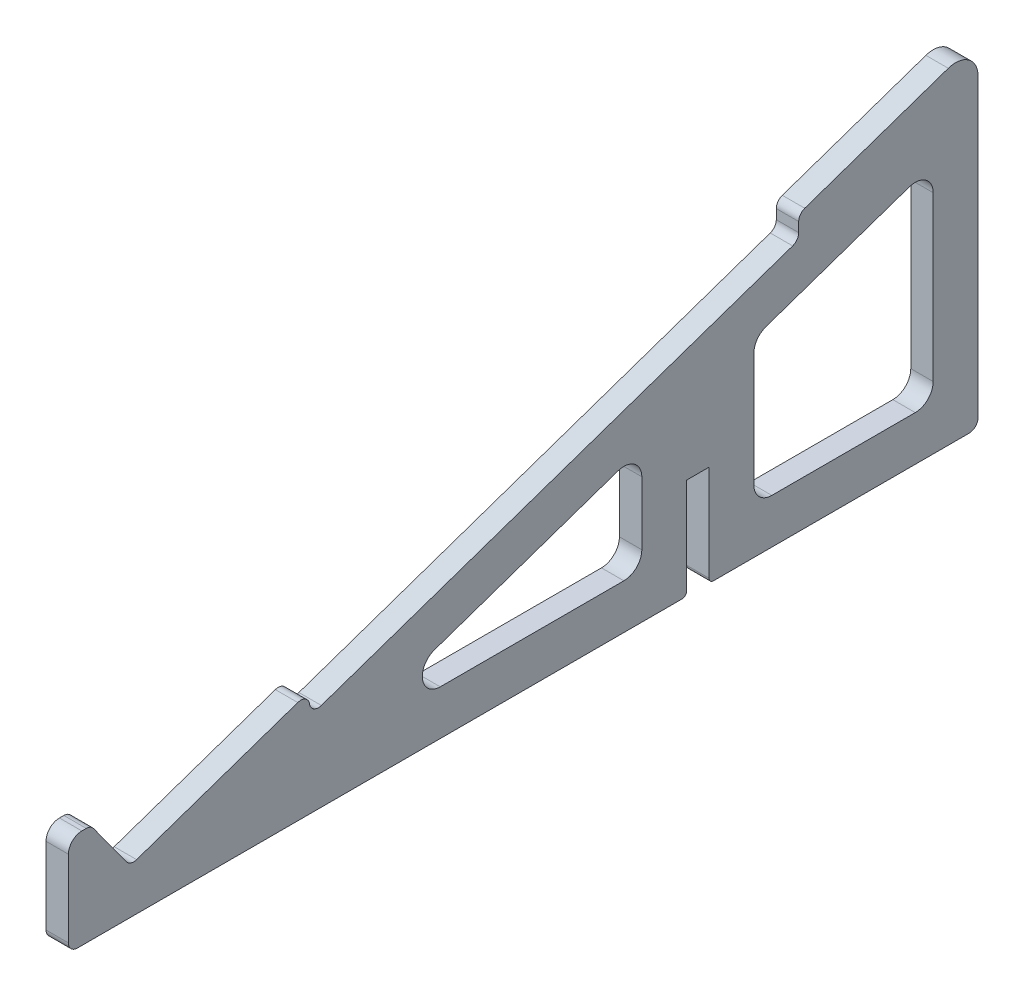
ISO-10303-21;
HEADER;
FILE_DESCRIPTION(('STEP AP214'),'2;1');
FILE_NAME('part.step','',(''),(''),'','','');
FILE_SCHEMA(('AUTOMOTIVE_DESIGN { 1 0 10303 214 1 1 1 1 }'));
ENDSEC;
DATA;
#1=APPLICATION_CONTEXT('core data for automotive mechanical design processes');
#2=APPLICATION_PROTOCOL_DEFINITION('international standard','automotive_design',2000,#1);
#3=PRODUCT_CONTEXT('',#1,'mechanical');
#4=PRODUCT('Part','Part','',(#3));
#5=PRODUCT_RELATED_PRODUCT_CATEGORY('part','',(#4));
#6=PRODUCT_DEFINITION_FORMATION('','',#4);
#7=PRODUCT_DEFINITION_CONTEXT('part definition',#1,'design');
#8=PRODUCT_DEFINITION('design','',#6,#7);
#9=PRODUCT_DEFINITION_SHAPE('','',#8);
#10=(LENGTH_UNIT() NAMED_UNIT(*) SI_UNIT(.MILLI.,.METRE.));
#11=(NAMED_UNIT(*) PLANE_ANGLE_UNIT() SI_UNIT($,.RADIAN.));
#12=(NAMED_UNIT(*) SI_UNIT($,.STERADIAN.) SOLID_ANGLE_UNIT());
#13=UNCERTAINTY_MEASURE_WITH_UNIT(LENGTH_MEASURE(1.E-05),#10,'distance_accuracy_value','');
#14=(GEOMETRIC_REPRESENTATION_CONTEXT(3) GLOBAL_UNCERTAINTY_ASSIGNED_CONTEXT((#13)) GLOBAL_UNIT_ASSIGNED_CONTEXT((#10,
#11,#12)) REPRESENTATION_CONTEXT('',''));
#15=CARTESIAN_POINT('',(0.,0.,0.));
#16=DIRECTION('',(0.,0.,1.));
#17=DIRECTION('',(1.,0.,0.));
#18=AXIS2_PLACEMENT_3D('',#15,#16,#17);
#19=CARTESIAN_POINT('',(6.35,0.,128.854513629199));
#20=DIRECTION('',(0.,1.,0.));
#21=DIRECTION('',(0.,0.,1.));
#22=AXIS2_PLACEMENT_3D('',#19,#20,#21);
#23=PLANE('',#22);
#24=DIRECTION('',(0.,0.,-1.));
#25=VECTOR('',#24,1.);
#26=CARTESIAN_POINT('',(0.,0.,128.854513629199));
#27=LINE('',#26,#25);
#28=CARTESIAN_POINT('',(0.,0.,126.314513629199));
#29=VERTEX_POINT('',#28);
#30=CARTESIAN_POINT('',(0.,0.,-45.0345136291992));
#31=VERTEX_POINT('',#30);
#32=EDGE_CURVE('E347',#29,#31,#27,.T.);
#33=ORIENTED_EDGE('',*,*,#32,.T.);
#34=DIRECTION('',(1.,0.,0.));
#35=VECTOR('',#34,1.);
#36=CARTESIAN_POINT('',(6.35,0.,-45.0345136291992));
#37=LINE('',#36,#35);
#38=CARTESIAN_POINT('',(6.35,0.,-45.0345136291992));
#39=VERTEX_POINT('',#38);
#40=EDGE_CURVE('E41',#31,#39,#37,.T.);
#41=ORIENTED_EDGE('',*,*,#40,.T.);
#42=DIRECTION('',(0.,0.,-1.));
#43=VECTOR('',#42,1.);
#44=CARTESIAN_POINT('',(6.35,0.,128.854513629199));
#45=LINE('',#44,#43);
#46=CARTESIAN_POINT('',(6.35,0.,126.314513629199));
#47=VERTEX_POINT('',#46);
#48=EDGE_CURVE('E329',#47,#39,#45,.T.);
#49=ORIENTED_EDGE('',*,*,#48,.F.);
#50=DIRECTION('',(-1.,0.,0.));
#51=VECTOR('',#50,1.);
#52=CARTESIAN_POINT('',(6.35,0.,126.314513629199));
#53=LINE('',#52,#51);
#54=EDGE_CURVE('E389',#47,#29,#53,.T.);
#55=ORIENTED_EDGE('',*,*,#54,.T.);
#56=EDGE_LOOP('',(#33,#41,#49,#55));
#57=FACE_BOUND('',#56,.T.);
#58=ADVANCED_FACE('F33',(#57),#23,.F.);
#59=CARTESIAN_POINT('',(6.35,95.3943112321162,-128.854513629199));
#60=DIRECTION('',(0.,-0.945518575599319,-0.32556815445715));
#61=DIRECTION('',(0.,0.32556815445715,-0.945518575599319));
#62=AXIS2_PLACEMENT_3D('',#59,#60,#61);
#63=PLANE('',#62);
#64=DIRECTION('',(0.,-0.32556815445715,0.945518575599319));
#65=VECTOR('',#64,1.);
#66=CARTESIAN_POINT('',(6.35,95.3943112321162,-128.854513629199));
#67=LINE('',#66,#65);
#68=CARTESIAN_POINT('',(6.35,92.4959825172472,-120.437155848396));
#69=VERTEX_POINT('',#68);
#70=CARTESIAN_POINT('',(6.35,78.4923212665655,-79.7675705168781));
#71=VERTEX_POINT('',#70);
#72=EDGE_CURVE('E336',#69,#71,#67,.T.);
#73=ORIENTED_EDGE('',*,*,#72,.F.);
#74=DIRECTION('',(-1.,0.,0.));
#75=VECTOR('',#74,1.);
#76=CARTESIAN_POINT('',(6.35,92.4959825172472,-120.437155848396));
#77=LINE('',#76,#75);
#78=CARTESIAN_POINT('',(0.,92.4959825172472,-120.437155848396));
#79=VERTEX_POINT('',#78);
#80=EDGE_CURVE('E445',#69,#79,#77,.T.);
#81=ORIENTED_EDGE('',*,*,#80,.T.);
#82=DIRECTION('',(0.,-0.32556815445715,0.945518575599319));
#83=VECTOR('',#82,1.);
#84=CARTESIAN_POINT('',(0.,95.3943112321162,-128.854513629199));
#85=LINE('',#84,#83);
#86=CARTESIAN_POINT('',(0.,78.4923212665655,-79.7675705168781));
#87=VERTEX_POINT('',#86);
#88=EDGE_CURVE('E353',#79,#87,#85,.T.);
#89=ORIENTED_EDGE('',*,*,#88,.T.);
#90=DIRECTION('',(1.,0.,0.));
#91=VECTOR('',#90,1.);
#92=CARTESIAN_POINT('',(6.35,78.4923212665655,-79.7675705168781));
#93=LINE('',#92,#91);
#94=EDGE_CURVE('E344',#87,#71,#93,.T.);
#95=ORIENTED_EDGE('',*,*,#94,.T.);
#96=EDGE_LOOP('',(#73,#81,#89,#95));
#97=FACE_BOUND('',#96,.T.);
#98=ADVANCED_FACE('F606',(#97),#63,.F.);
#99=CARTESIAN_POINT('',(6.35,0.,128.854513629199));
#100=DIRECTION('',(0.,0.,-1.));
#101=DIRECTION('',(0.,1.,0.));
#102=AXIS2_PLACEMENT_3D('',#99,#100,#101);
#103=PLANE('',#102);
#104=DIRECTION('',(0.,-1.,0.));
#105=VECTOR('',#104,1.);
#106=CARTESIAN_POINT('',(6.35,0.,128.854513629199));
#107=LINE('',#106,#105);
#108=CARTESIAN_POINT('',(6.35,24.3017737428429,128.854513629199));
#109=VERTEX_POINT('',#108);
#110=CARTESIAN_POINT('',(6.35,2.54,128.854513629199));
#111=VERTEX_POINT('',#110);
#112=EDGE_CURVE('E325',#109,#111,#107,.T.);
#113=ORIENTED_EDGE('',*,*,#112,.F.);
#114=DIRECTION('',(-1.,0.,0.));
#115=VECTOR('',#114,1.);
#116=CARTESIAN_POINT('',(6.35,24.3017737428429,128.854513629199));
#117=LINE('',#116,#115);
#118=CARTESIAN_POINT('',(0.,24.3017737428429,128.854513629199));
#119=VERTEX_POINT('',#118);
#120=EDGE_CURVE('E436',#109,#119,#117,.T.);
#121=ORIENTED_EDGE('',*,*,#120,.T.);
#122=DIRECTION('',(0.,-1.,0.));
#123=VECTOR('',#122,1.);
#124=CARTESIAN_POINT('',(0.,0.,128.854513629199));
#125=LINE('',#124,#123);
#126=CARTESIAN_POINT('',(0.,2.54,128.854513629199));
#127=VERTEX_POINT('',#126);
#128=EDGE_CURVE('E321',#119,#127,#125,.T.);
#129=ORIENTED_EDGE('',*,*,#128,.T.);
#130=DIRECTION('',(-1.,0.,0.));
#131=VECTOR('',#130,1.);
#132=CARTESIAN_POINT('',(6.35,2.54,128.854513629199));
#133=LINE('',#132,#131);
#134=EDGE_CURVE('E401',#127,#111,#133,.F.);
#135=ORIENTED_EDGE('',*,*,#134,.T.);
#136=EDGE_LOOP('',(#113,#121,#129,#135));
#137=FACE_BOUND('',#136,.T.);
#138=ADVANCED_FACE('F545',(#137),#103,.F.);
#139=CARTESIAN_POINT('',(6.35,0.,-53.9245136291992));
#140=VERTEX_POINT('',#139);
#141=CARTESIAN_POINT('',(6.35,0.,-126.314513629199));
#142=VERTEX_POINT('',#141);
#143=EDGE_CURVE('E327',#140,#142,#45,.T.);
#144=ORIENTED_EDGE('',*,*,#143,.F.);
#145=DIRECTION('',(1.,0.,0.));
#146=VECTOR('',#145,1.);
#147=CARTESIAN_POINT('',(6.35,0.,-53.9245136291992));
#148=LINE('',#147,#146);
#149=CARTESIAN_POINT('',(0.,0.,-53.9245136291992));
#150=VERTEX_POINT('',#149);
#151=EDGE_CURVE('E524',#140,#150,#148,.F.);
#152=ORIENTED_EDGE('',*,*,#151,.T.);
#153=CARTESIAN_POINT('',(0.,0.,-126.314513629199));
#154=VERTEX_POINT('',#153);
#155=EDGE_CURVE('E346',#150,#154,#27,.T.);
#156=ORIENTED_EDGE('',*,*,#155,.T.);
#157=DIRECTION('',(-1.,0.,0.));
#158=VECTOR('',#157,1.);
#159=CARTESIAN_POINT('',(6.35,0.,-126.314513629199));
#160=LINE('',#159,#158);
#161=EDGE_CURVE('E392',#154,#142,#160,.F.);
#162=ORIENTED_EDGE('',*,*,#161,.T.);
#163=EDGE_LOOP('',(#144,#152,#156,#162));
#164=FACE_BOUND('',#163,.T.);
#165=ADVANCED_FACE('F637',(#164),#23,.F.);
#166=CARTESIAN_POINT('',(6.35,0.,-128.854513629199));
#167=DIRECTION('',(0.,0.,1.));
#168=DIRECTION('',(1.,0.,0.));
#169=AXIS2_PLACEMENT_3D('',#166,#167,#168);
#170=PLANE('',#169);
#171=DIRECTION('',(0.,1.,0.));
#172=VECTOR('',#171,1.);
#173=CARTESIAN_POINT('',(0.,0.,-128.854513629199));
#174=LINE('',#173,#172);
#175=CARTESIAN_POINT('',(0.,2.54,-128.854513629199));
#176=VERTEX_POINT('',#175);
#177=CARTESIAN_POINT('',(0.,86.4919395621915,-128.854513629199));
#178=VERTEX_POINT('',#177);
#179=EDGE_CURVE('E349',#176,#178,#174,.T.);
#180=ORIENTED_EDGE('',*,*,#179,.T.);
#181=DIRECTION('',(-1.,0.,0.));
#182=VECTOR('',#181,1.);
#183=CARTESIAN_POINT('',(6.35,86.4919395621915,-128.854513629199));
#184=LINE('',#183,#182);
#185=CARTESIAN_POINT('',(6.35,86.4919395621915,-128.854513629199));
#186=VERTEX_POINT('',#185);
#187=EDGE_CURVE('E450',#178,#186,#184,.F.);
#188=ORIENTED_EDGE('',*,*,#187,.T.);
#189=DIRECTION('',(0.,1.,0.));
#190=VECTOR('',#189,1.);
#191=CARTESIAN_POINT('',(6.35,0.,-128.854513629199));
#192=LINE('',#191,#190);
#193=CARTESIAN_POINT('',(6.35,2.54,-128.854513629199));
#194=VERTEX_POINT('',#193);
#195=EDGE_CURVE('E332',#194,#186,#192,.T.);
#196=ORIENTED_EDGE('',*,*,#195,.F.);
#197=DIRECTION('',(-1.,0.,0.));
#198=VECTOR('',#197,1.);
#199=CARTESIAN_POINT('',(6.35,2.54,-128.854513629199));
#200=LINE('',#199,#198);
#201=EDGE_CURVE('E378',#194,#176,#200,.T.);
#202=ORIENTED_EDGE('',*,*,#201,.T.);
#203=EDGE_LOOP('',(#180,#188,#196,#202));
#204=FACE_BOUND('',#203,.T.);
#205=ADVANCED_FACE('F614',(#204),#170,.F.);
#206=CARTESIAN_POINT('',(0.,29.032511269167,63.874147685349));
#207=VERTEX_POINT('',#206);
#208=CARTESIAN_POINT('',(0.,13.3119057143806,109.530101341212));
#209=VERTEX_POINT('',#208);
#210=EDGE_CURVE('E352',#207,#209,#85,.T.);
#211=ORIENTED_EDGE('',*,*,#210,.T.);
#212=DIRECTION('',(-1.,0.,0.));
#213=VECTOR('',#212,1.);
#214=CARTESIAN_POINT('',(6.35,13.3119057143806,109.530101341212));
#215=LINE('',#214,#213);
#216=CARTESIAN_POINT('',(6.35,13.3119057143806,109.530101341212));
#217=VERTEX_POINT('',#216);
#218=EDGE_CURVE('E412',#209,#217,#215,.F.);
#219=ORIENTED_EDGE('',*,*,#218,.T.);
#220=CARTESIAN_POINT('',(6.35,29.032511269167,63.874147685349));
#221=VERTEX_POINT('',#220);
#222=EDGE_CURVE('E335',#221,#217,#67,.T.);
#223=ORIENTED_EDGE('',*,*,#222,.F.);
#224=DIRECTION('',(1.,0.,0.));
#225=VECTOR('',#224,1.);
#226=CARTESIAN_POINT('',(6.35,29.032511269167,63.874147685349));
#227=LINE('',#226,#225);
#228=EDGE_CURVE('E376',#221,#207,#227,.F.);
#229=ORIENTED_EDGE('',*,*,#228,.T.);
#230=EDGE_LOOP('',(#211,#219,#223,#229));
#231=FACE_BOUND('',#230,.T.);
#232=ADVANCED_FACE('F572',(#231),#63,.F.);
#233=CARTESIAN_POINT('',(6.35,12.7,111.307204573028));
#234=DIRECTION('',(0.,-0.587785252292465,0.809016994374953));
#235=DIRECTION('',(0.,-0.809016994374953,-0.587785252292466));
#236=AXIS2_PLACEMENT_3D('',#233,#234,#235);
#237=PLANE('',#236);
#238=DIRECTION('',(0.,0.809016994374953,0.587785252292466));
#239=VECTOR('',#238,1.);
#240=CARTESIAN_POINT('',(0.,12.7,111.307204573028));
#241=LINE('',#240,#239);
#242=CARTESIAN_POINT('',(0.,14.22054835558,112.411947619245));
#243=VERTEX_POINT('',#242);
#244=CARTESIAN_POINT('',(0.,27.0647482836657,121.743805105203));
#245=VERTEX_POINT('',#244);
#246=EDGE_CURVE('E355',#243,#245,#241,.T.);
#247=ORIENTED_EDGE('',*,*,#246,.T.);
#248=DIRECTION('',(-1.,0.,0.));
#249=VECTOR('',#248,1.);
#250=CARTESIAN_POINT('',(6.35,27.0647482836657,121.743805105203));
#251=LINE('',#250,#249);
#252=CARTESIAN_POINT('',(6.35,27.0647482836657,121.743805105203));
#253=VERTEX_POINT('',#252);
#254=EDGE_CURVE('E410',#245,#253,#251,.F.);
#255=ORIENTED_EDGE('',*,*,#254,.T.);
#256=DIRECTION('',(0.,0.809016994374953,0.587785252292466));
#257=VECTOR('',#256,1.);
#258=CARTESIAN_POINT('',(6.35,12.7,111.307204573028));
#259=LINE('',#258,#257);
#260=CARTESIAN_POINT('',(6.35,14.22054835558,112.411947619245));
#261=VERTEX_POINT('',#260);
#262=EDGE_CURVE('E338',#261,#253,#259,.T.);
#263=ORIENTED_EDGE('',*,*,#262,.F.);
#264=DIRECTION('',(-1.,0.,0.));
#265=VECTOR('',#264,1.);
#266=CARTESIAN_POINT('',(0.,14.22054835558,112.411947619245));
#267=LINE('',#266,#265);
#268=EDGE_CURVE('E407',#261,#243,#267,.T.);
#269=ORIENTED_EDGE('',*,*,#268,.T.);
#270=EDGE_LOOP('',(#247,#255,#263,#269));
#271=FACE_BOUND('',#270,.T.);
#272=ADVANCED_FACE('F562',(#271),#237,.F.);
#273=CARTESIAN_POINT('',(6.35,28.1117737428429,122.504513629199));
#274=DIRECTION('',(0.,-1.,0.));
#275=DIRECTION('',(0.,0.,-1.));
#276=AXIS2_PLACEMENT_3D('',#273,#274,#275);
#277=PLANE('',#276);
#278=DIRECTION('',(0.,0.,1.));
#279=VECTOR('',#278,1.);
#280=CARTESIAN_POINT('',(0.,28.1117737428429,122.504513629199));
#281=LINE('',#280,#279);
#282=CARTESIAN_POINT('',(0.,28.1117737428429,123.798708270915));
#283=VERTEX_POINT('',#282);
#284=CARTESIAN_POINT('',(0.,28.1117737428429,125.044513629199));
#285=VERTEX_POINT('',#284);
#286=EDGE_CURVE('E328',#283,#285,#281,.T.);
#287=ORIENTED_EDGE('',*,*,#286,.T.);
#288=DIRECTION('',(-1.,0.,0.));
#289=VECTOR('',#288,1.);
#290=CARTESIAN_POINT('',(6.35,28.1117737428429,125.044513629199));
#291=LINE('',#290,#289);
#292=CARTESIAN_POINT('',(6.35,28.1117737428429,125.044513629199));
#293=VERTEX_POINT('',#292);
#294=EDGE_CURVE('E441',#285,#293,#291,.F.);
#295=ORIENTED_EDGE('',*,*,#294,.T.);
#296=DIRECTION('',(0.,0.,1.));
#297=VECTOR('',#296,1.);
#298=CARTESIAN_POINT('',(6.35,28.1117737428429,122.504513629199));
#299=LINE('',#298,#297);
#300=CARTESIAN_POINT('',(6.35,28.1117737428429,123.798708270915));
#301=VERTEX_POINT('',#300);
#302=EDGE_CURVE('E341',#301,#293,#299,.T.);
#303=ORIENTED_EDGE('',*,*,#302,.F.);
#304=DIRECTION('',(-1.,0.,0.));
#305=VECTOR('',#304,1.);
#306=CARTESIAN_POINT('',(6.35,28.1117737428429,123.798708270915));
#307=LINE('',#306,#305);
#308=EDGE_CURVE('E404',#301,#283,#307,.T.);
#309=ORIENTED_EDGE('',*,*,#308,.T.);
#310=EDGE_LOOP('',(#287,#295,#303,#309));
#311=FACE_BOUND('',#310,.T.);
#312=ADVANCED_FACE('F553',(#311),#277,.F.);
#313=CARTESIAN_POINT('',(6.35,0.,0.));
#314=DIRECTION('',(1.,0.,0.));
#315=DIRECTION('',(0.,0.,-1.));
#316=AXIS2_PLACEMENT_3D('',#313,#314,#315);
#317=PLANE('',#316);
#318=DIRECTION('',(0.,0.,-1.));
#319=VECTOR('',#318,1.);
#320=CARTESIAN_POINT('',(6.35,12.7,53.8567362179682));
#321=LINE('',#320,#319);
#322=CARTESIAN_POINT('',(6.35,12.7,23.4998532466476));
#323=VERTEX_POINT('',#322);
#324=CARTESIAN_POINT('',(6.35,12.7,-28.5245136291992));
#325=VERTEX_POINT('',#324);
#326=EDGE_CURVE('E1047',#323,#325,#321,.T.);
#327=ORIENTED_EDGE('',*,*,#326,.F.);
#328=CARTESIAN_POINT('',(6.35,17.78,23.4998532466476));
#329=DIRECTION('',(1.,0.,0.));
#330=DIRECTION('',(0.,0.,-1.));
#331=AXIS2_PLACEMENT_3D('',#328,#329,#330);
#332=CIRCLE('',#331,5.08);
#333=CARTESIAN_POINT('',(6.35,22.5832343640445,25.15373947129));
#334=VERTEX_POINT('',#333);
#335=EDGE_CURVE('E501',#323,#334,#332,.F.);
#336=ORIENTED_EDGE('',*,*,#335,.T.);
#337=DIRECTION('',(0.,-0.325568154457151,0.945518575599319));
#338=VECTOR('',#337,1.);
#339=CARTESIAN_POINT('',(6.35,42.8153234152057,-33.6045136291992));
#340=LINE('',#339,#338);
#341=CARTESIAN_POINT('',(6.35,40.4966604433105,-26.8706274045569));
#342=VERTEX_POINT('',#341);
#343=EDGE_CURVE('E726',#342,#334,#340,.T.);
#344=ORIENTED_EDGE('',*,*,#343,.F.);
#345=CARTESIAN_POINT('',(6.35,35.6934260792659,-28.5245136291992));
#346=DIRECTION('',(1.,0.,0.));
#347=DIRECTION('',(0.,0.,-1.));
#348=AXIS2_PLACEMENT_3D('',#345,#346,#347);
#349=CIRCLE('',#348,5.08);
#350=CARTESIAN_POINT('',(6.35,35.6934260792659,-33.6045136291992));
#351=VERTEX_POINT('',#350);
#352=EDGE_CURVE('E509',#342,#351,#349,.F.);
#353=ORIENTED_EDGE('',*,*,#352,.T.);
#354=DIRECTION('',(0.,1.,0.));
#355=VECTOR('',#354,1.);
#356=CARTESIAN_POINT('',(6.35,12.7,-33.6045136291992));
#357=LINE('',#356,#355);
#358=CARTESIAN_POINT('',(6.35,17.78,-33.6045136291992));
#359=VERTEX_POINT('',#358);
#360=EDGE_CURVE('E1048',#359,#351,#357,.T.);
#361=ORIENTED_EDGE('',*,*,#360,.F.);
#362=CARTESIAN_POINT('',(6.35,17.78,-28.5245136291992));
#363=DIRECTION('',(1.,0.,0.));
#364=DIRECTION('',(0.,0.,-1.));
#365=AXIS2_PLACEMENT_3D('',#362,#363,#364);
#366=CIRCLE('',#365,5.08);
#367=EDGE_CURVE('E493',#359,#325,#366,.F.);
#368=ORIENTED_EDGE('',*,*,#367,.T.);
#369=EDGE_LOOP('',(#327,#336,#344,#353,#361,#368));
#370=FACE_BOUND('',#369,.T.);
#371=DIRECTION('',(0.,-1.,0.));
#372=VECTOR('',#371,1.);
#373=CARTESIAN_POINT('',(6.35,53.7477251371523,-65.3545136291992));
#374=LINE('',#373,#372);
#375=CARTESIAN_POINT('',(6.35,50.1241963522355,-65.3545136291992));
#376=VERTEX_POINT('',#375);
#377=CARTESIAN_POINT('',(6.35,17.78,-65.3545136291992));
#378=VERTEX_POINT('',#377);
#379=EDGE_CURVE('E731',#376,#378,#374,.T.);
#380=ORIENTED_EDGE('',*,*,#379,.F.);
#381=CARTESIAN_POINT('',(6.35,50.1241963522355,-70.4345136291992));
#382=DIRECTION('',(1.,0.,0.));
#383=DIRECTION('',(0.,0.,-1.));
#384=AXIS2_PLACEMENT_3D('',#381,#382,#383);
#385=CIRCLE('',#384,5.08);
#386=CARTESIAN_POINT('',(6.35,54.92743071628,-68.7806274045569));
#387=VERTEX_POINT('',#386);
#388=EDGE_CURVE('E513',#376,#387,#385,.F.);
#389=ORIENTED_EDGE('',*,*,#388,.T.);
#390=DIRECTION('',(0.,-0.325568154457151,0.945518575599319));
#391=VECTOR('',#390,1.);
#392=CARTESIAN_POINT('',(6.35,71.239567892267,-116.154513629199));
#393=LINE('',#392,#391);
#394=CARTESIAN_POINT('',(6.35,68.9209049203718,-109.420627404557));
#395=VERTEX_POINT('',#394);
#396=EDGE_CURVE('E718',#395,#387,#393,.T.);
#397=ORIENTED_EDGE('',*,*,#396,.F.);
#398=CARTESIAN_POINT('',(6.35,64.1176705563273,-111.074513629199));
#399=DIRECTION('',(1.,0.,0.));
#400=DIRECTION('',(0.,0.,-1.));
#401=AXIS2_PLACEMENT_3D('',#398,#399,#400);
#402=CIRCLE('',#401,5.08);
#403=CARTESIAN_POINT('',(6.35,64.1176705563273,-116.154513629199));
#404=VERTEX_POINT('',#403);
#405=EDGE_CURVE('E505',#395,#404,#402,.F.);
#406=ORIENTED_EDGE('',*,*,#405,.T.);
#407=DIRECTION('',(0.,1.,0.));
#408=VECTOR('',#407,1.);
#409=CARTESIAN_POINT('',(6.35,12.7,-116.154513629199));
#410=LINE('',#409,#408);
#411=CARTESIAN_POINT('',(6.35,17.78,-116.154513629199));
#412=VERTEX_POINT('',#411);
#413=EDGE_CURVE('E724',#412,#404,#410,.T.);
#414=ORIENTED_EDGE('',*,*,#413,.F.);
#415=CARTESIAN_POINT('',(6.35,17.78,-111.074513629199));
#416=DIRECTION('',(1.,0.,0.));
#417=DIRECTION('',(0.,0.,-1.));
#418=AXIS2_PLACEMENT_3D('',#415,#416,#417);
#419=CIRCLE('',#418,5.08);
#420=CARTESIAN_POINT('',(6.35,12.7,-111.074513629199));
#421=VERTEX_POINT('',#420);
#422=EDGE_CURVE('E489',#412,#421,#419,.F.);
#423=ORIENTED_EDGE('',*,*,#422,.T.);
#424=DIRECTION('',(0.,0.,-1.));
#425=VECTOR('',#424,1.);
#426=CARTESIAN_POINT('',(6.35,12.7,-65.3545136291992));
#427=LINE('',#426,#425);
#428=CARTESIAN_POINT('',(6.35,12.7,-70.4345136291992));
#429=VERTEX_POINT('',#428);
#430=EDGE_CURVE('E733',#429,#421,#427,.T.);
#431=ORIENTED_EDGE('',*,*,#430,.F.);
#432=CARTESIAN_POINT('',(6.35,17.78,-70.4345136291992));
#433=DIRECTION('',(1.,0.,0.));
#434=DIRECTION('',(0.,0.,-1.));
#435=AXIS2_PLACEMENT_3D('',#432,#433,#434);
#436=CIRCLE('',#435,5.08);
#437=EDGE_CURVE('E497',#429,#378,#436,.F.);
#438=ORIENTED_EDGE('',*,*,#437,.T.);
#439=EDGE_LOOP('',(#380,#389,#397,#406,#414,#423,#431,#438));
#440=FACE_BOUND('',#439,.T.);
#441=DIRECTION('',(0.,1.,0.));
#442=VECTOR('',#441,1.);
#443=CARTESIAN_POINT('',(6.35,0.,-52.6545136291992));
#444=LINE('',#443,#442);
#445=CARTESIAN_POINT('',(6.35,1.27,-52.6545136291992));
#446=VERTEX_POINT('',#445);
#447=CARTESIAN_POINT('',(6.35,28.5165470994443,-52.6545136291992));
#448=VERTEX_POINT('',#447);
#449=EDGE_CURVE('E309',#446,#448,#444,.T.);
#450=ORIENTED_EDGE('',*,*,#449,.F.);
#451=CARTESIAN_POINT('',(6.35,1.27,-53.9245136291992));
#452=DIRECTION('',(1.,0.,0.));
#453=DIRECTION('',(0.,0.,-1.));
#454=AXIS2_PLACEMENT_3D('',#451,#452,#453);
#455=CIRCLE('',#454,1.27);
#456=EDGE_CURVE('E522',#446,#140,#455,.T.);
#457=ORIENTED_EDGE('',*,*,#456,.T.);
#458=ORIENTED_EDGE('',*,*,#143,.T.);
#459=CARTESIAN_POINT('',(6.35,2.54,-126.314513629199));
#460=DIRECTION('',(1.,0.,0.));
#461=DIRECTION('',(0.,0.,-1.));
#462=AXIS2_PLACEMENT_3D('',#459,#460,#461);
#463=CIRCLE('',#462,2.54);
#464=EDGE_CURVE('E399',#142,#194,#463,.T.);
#465=ORIENTED_EDGE('',*,*,#464,.T.);
#466=ORIENTED_EDGE('',*,*,#195,.T.);
#467=CARTESIAN_POINT('',(6.35,86.4919395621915,-122.504513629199));
#468=DIRECTION('',(1.,0.,0.));
#469=DIRECTION('',(0.,0.,-1.));
#470=AXIS2_PLACEMENT_3D('',#467,#468,#469);
#471=CIRCLE('',#470,6.35);
#472=EDGE_CURVE('E452',#186,#69,#471,.T.);
#473=ORIENTED_EDGE('',*,*,#472,.T.);
#474=ORIENTED_EDGE('',*,*,#72,.T.);
#475=CARTESIAN_POINT('',(6.35,76.0907040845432,-80.5945136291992));
#476=DIRECTION('',(1.,0.,0.));
#477=DIRECTION('',(0.,0.,-1.));
#478=AXIS2_PLACEMENT_3D('',#475,#476,#477);
#479=CIRCLE('',#478,2.54);
#480=CARTESIAN_POINT('',(6.35,76.0907040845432,-78.0545136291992));
#481=VERTEX_POINT('',#480);
#482=EDGE_CURVE('E364',#71,#481,#479,.T.);
#483=ORIENTED_EDGE('',*,*,#482,.T.);
#484=DIRECTION('',(0.,1.,0.));
#485=VECTOR('',#484,1.);
#486=CARTESIAN_POINT('',(6.35,77.9024684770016,-78.0545136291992));
#487=LINE('',#486,#485);
#488=CARTESIAN_POINT('',(6.35,73.36423286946,-78.0545136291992));
#489=VERTEX_POINT('',#488);
#490=EDGE_CURVE('E319',#489,#481,#487,.T.);
#491=ORIENTED_EDGE('',*,*,#490,.F.);
#492=CARTESIAN_POINT('',(6.35,73.36423286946,-75.5145136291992));
#493=DIRECTION('',(1.,0.,0.));
#494=DIRECTION('',(0.,0.,-1.));
#495=AXIS2_PLACEMENT_3D('',#492,#493,#494);
#496=CIRCLE('',#495,2.54);
#497=CARTESIAN_POINT('',(6.35,70.9626156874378,-76.3414567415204));
#498=VERTEX_POINT('',#497);
#499=EDGE_CURVE('E428',#489,#498,#496,.F.);
#500=ORIENTED_EDGE('',*,*,#499,.T.);
#501=DIRECTION('',(0.,0.325568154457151,-0.945518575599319));
#502=VECTOR('',#501,1.);
#503=CARTESIAN_POINT('',(6.35,71.5524684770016,-78.0545136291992));
#504=LINE('',#503,#502);
#505=CARTESIAN_POINT('',(6.35,24.9818721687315,57.1963187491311));
#506=VERTEX_POINT('',#505);
#507=EDGE_CURVE('E294',#506,#498,#504,.T.);
#508=ORIENTED_EDGE('',*,*,#507,.F.);
#509=CARTESIAN_POINT('',(6.35,27.3834893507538,58.0232618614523));
#510=DIRECTION('',(1.,0.,0.));
#511=DIRECTION('',(0.,0.,-1.));
#512=AXIS2_PLACEMENT_3D('',#509,#510,#511);
#513=CIRCLE('',#512,2.54);
#514=CARTESIAN_POINT('',(6.35,27.0071917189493,60.53523321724));
#515=VERTEX_POINT('',#514);
#516=EDGE_CURVE('E432',#506,#515,#513,.F.);
#517=ORIENTED_EDGE('',*,*,#516,.T.);
#518=CARTESIAN_POINT('',(6.35,26.6308940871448,63.0472045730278));
#519=DIRECTION('',(1.,0.,0.));
#520=DIRECTION('',(0.,0.,-1.));
#521=AXIS2_PLACEMENT_3D('',#518,#519,#520);
#522=CIRCLE('',#521,2.54);
#523=EDGE_CURVE('E362',#515,#221,#522,.T.);
#524=ORIENTED_EDGE('',*,*,#523,.T.);
#525=ORIENTED_EDGE('',*,*,#222,.T.);
#526=CARTESIAN_POINT('',(6.35,15.7135228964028,110.357044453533));
#527=DIRECTION('',(1.,0.,0.));
#528=DIRECTION('',(0.,0.,-1.));
#529=AXIS2_PLACEMENT_3D('',#526,#527,#528);
#530=CIRCLE('',#529,2.54);
#531=EDGE_CURVE('E426',#217,#261,#530,.F.);
#532=ORIENTED_EDGE('',*,*,#531,.T.);
#533=ORIENTED_EDGE('',*,*,#262,.T.);
#534=CARTESIAN_POINT('',(6.35,25.5717737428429,123.798708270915));
#535=DIRECTION('',(1.,0.,0.));
#536=DIRECTION('',(0.,0.,-1.));
#537=AXIS2_PLACEMENT_3D('',#534,#535,#536);
#538=CIRCLE('',#537,2.54);
#539=EDGE_CURVE('E395',#253,#301,#538,.T.);
#540=ORIENTED_EDGE('',*,*,#539,.T.);
#541=ORIENTED_EDGE('',*,*,#302,.T.);
#542=CARTESIAN_POINT('',(6.35,24.3017737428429,125.044513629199));
#543=DIRECTION('',(1.,0.,0.));
#544=DIRECTION('',(0.,0.,-1.));
#545=AXIS2_PLACEMENT_3D('',#542,#543,#544);
#546=CIRCLE('',#545,3.81);
#547=EDGE_CURVE('E443',#293,#109,#546,.T.);
#548=ORIENTED_EDGE('',*,*,#547,.T.);
#549=ORIENTED_EDGE('',*,*,#112,.T.);
#550=CARTESIAN_POINT('',(6.35,2.54,126.314513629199));
#551=DIRECTION('',(1.,0.,0.));
#552=DIRECTION('',(0.,0.,-1.));
#553=AXIS2_PLACEMENT_3D('',#550,#551,#552);
#554=CIRCLE('',#553,2.54);
#555=EDGE_CURVE('E397',#111,#47,#554,.T.);
#556=ORIENTED_EDGE('',*,*,#555,.T.);
#557=ORIENTED_EDGE('',*,*,#48,.T.);
#558=CARTESIAN_POINT('',(6.35,1.27,-45.0345136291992));
#559=DIRECTION('',(1.,0.,0.));
#560=DIRECTION('',(0.,0.,-1.));
#561=AXIS2_PLACEMENT_3D('',#558,#559,#560);
#562=CIRCLE('',#561,1.27);
#563=CARTESIAN_POINT('',(6.35,1.27,-46.3045136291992));
#564=VERTEX_POINT('',#563);
#565=EDGE_CURVE('E520',#39,#564,#562,.T.);
#566=ORIENTED_EDGE('',*,*,#565,.T.);
#567=DIRECTION('',(0.,-1.,0.));
#568=VECTOR('',#567,1.);
#569=CARTESIAN_POINT('',(6.35,28.5165470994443,-46.3045136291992));
#570=LINE('',#569,#568);
#571=CARTESIAN_POINT('',(6.35,28.5165470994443,-46.3045136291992));
#572=VERTEX_POINT('',#571);
#573=EDGE_CURVE('E305',#572,#564,#570,.T.);
#574=ORIENTED_EDGE('',*,*,#573,.F.);
#575=DIRECTION('',(0.,0.,1.));
#576=VECTOR('',#575,1.);
#577=CARTESIAN_POINT('',(6.35,28.5165470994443,-52.6545136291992));
#578=LINE('',#577,#576);
#579=EDGE_CURVE('E292',#448,#572,#578,.T.);
#580=ORIENTED_EDGE('',*,*,#579,.F.);
#581=EDGE_LOOP('',(#450,#457,#458,#465,#466,#473,#474,#483,#491,#500,#508,#517,#524,#525,#532,
#533,#540,#541,#548,#549,#556,#557,#566,#574,#580));
#582=FACE_BOUND('',#581,.T.);
#583=ADVANCED_FACE('F536',(#370,#440,#582),#317,.T.);
#584=CARTESIAN_POINT('',(0.,0.,0.));
#585=DIRECTION('',(1.,0.,0.));
#586=DIRECTION('',(0.,0.,-1.));
#587=AXIS2_PLACEMENT_3D('',#584,#585,#586);
#588=PLANE('',#587);
#589=DIRECTION('',(0.,1.,0.));
#590=VECTOR('',#589,1.);
#591=CARTESIAN_POINT('',(0.,12.7,-33.6045136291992));
#592=LINE('',#591,#590);
#593=CARTESIAN_POINT('',(0.,17.78,-33.6045136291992));
#594=VERTEX_POINT('',#593);
#595=CARTESIAN_POINT('',(0.,35.6934260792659,-33.6045136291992));
#596=VERTEX_POINT('',#595);
#597=EDGE_CURVE('E1035',#594,#596,#592,.T.);
#598=ORIENTED_EDGE('',*,*,#597,.T.);
#599=CARTESIAN_POINT('',(0.,35.6934260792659,-28.5245136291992));
#600=DIRECTION('',(1.,0.,0.));
#601=DIRECTION('',(0.,0.,-1.));
#602=AXIS2_PLACEMENT_3D('',#599,#600,#601);
#603=CIRCLE('',#602,5.08);
#604=CARTESIAN_POINT('',(0.,40.4966604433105,-26.8706274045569));
#605=VERTEX_POINT('',#604);
#606=EDGE_CURVE('E511',#596,#605,#603,.T.);
#607=ORIENTED_EDGE('',*,*,#606,.T.);
#608=DIRECTION('',(0.,-0.325568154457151,0.945518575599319));
#609=VECTOR('',#608,1.);
#610=CARTESIAN_POINT('',(0.,42.8153234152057,-33.6045136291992));
#611=LINE('',#610,#609);
#612=CARTESIAN_POINT('',(0.,22.5832343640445,25.15373947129));
#613=VERTEX_POINT('',#612);
#614=EDGE_CURVE('E734',#605,#613,#611,.T.);
#615=ORIENTED_EDGE('',*,*,#614,.T.);
#616=CARTESIAN_POINT('',(0.,17.78,23.4998532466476));
#617=DIRECTION('',(1.,0.,0.));
#618=DIRECTION('',(0.,0.,-1.));
#619=AXIS2_PLACEMENT_3D('',#616,#617,#618);
#620=CIRCLE('',#619,5.08);
#621=CARTESIAN_POINT('',(0.,12.7,23.4998532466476));
#622=VERTEX_POINT('',#621);
#623=EDGE_CURVE('E503',#613,#622,#620,.T.);
#624=ORIENTED_EDGE('',*,*,#623,.T.);
#625=DIRECTION('',(0.,0.,-1.));
#626=VECTOR('',#625,1.);
#627=CARTESIAN_POINT('',(0.,12.7,53.8567362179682));
#628=LINE('',#627,#626);
#629=CARTESIAN_POINT('',(0.,12.7,-28.5245136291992));
#630=VERTEX_POINT('',#629);
#631=EDGE_CURVE('E1041',#622,#630,#628,.T.);
#632=ORIENTED_EDGE('',*,*,#631,.T.);
#633=CARTESIAN_POINT('',(0.,17.78,-28.5245136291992));
#634=DIRECTION('',(1.,0.,0.));
#635=DIRECTION('',(0.,0.,-1.));
#636=AXIS2_PLACEMENT_3D('',#633,#634,#635);
#637=CIRCLE('',#636,5.08);
#638=EDGE_CURVE('E495',#630,#594,#637,.T.);
#639=ORIENTED_EDGE('',*,*,#638,.T.);
#640=EDGE_LOOP('',(#598,#607,#615,#624,#632,#639));
#641=FACE_BOUND('',#640,.T.);
#642=DIRECTION('',(0.,1.,0.));
#643=VECTOR('',#642,1.);
#644=CARTESIAN_POINT('',(0.,12.7,-116.154513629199));
#645=LINE('',#644,#643);
#646=CARTESIAN_POINT('',(0.,17.78,-116.154513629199));
#647=VERTEX_POINT('',#646);
#648=CARTESIAN_POINT('',(0.,64.1176705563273,-116.154513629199));
#649=VERTEX_POINT('',#648);
#650=EDGE_CURVE('E721',#647,#649,#645,.T.);
#651=ORIENTED_EDGE('',*,*,#650,.T.);
#652=CARTESIAN_POINT('',(0.,64.1176705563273,-111.074513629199));
#653=DIRECTION('',(1.,0.,0.));
#654=DIRECTION('',(0.,0.,-1.));
#655=AXIS2_PLACEMENT_3D('',#652,#653,#654);
#656=CIRCLE('',#655,5.08);
#657=CARTESIAN_POINT('',(0.,68.9209049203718,-109.420627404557));
#658=VERTEX_POINT('',#657);
#659=EDGE_CURVE('E507',#649,#658,#656,.T.);
#660=ORIENTED_EDGE('',*,*,#659,.T.);
#661=DIRECTION('',(0.,-0.325568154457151,0.945518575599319));
#662=VECTOR('',#661,1.);
#663=CARTESIAN_POINT('',(0.,71.239567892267,-116.154513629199));
#664=LINE('',#663,#662);
#665=CARTESIAN_POINT('',(0.,54.92743071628,-68.7806274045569));
#666=VERTEX_POINT('',#665);
#667=EDGE_CURVE('E311',#658,#666,#664,.T.);
#668=ORIENTED_EDGE('',*,*,#667,.T.);
#669=CARTESIAN_POINT('',(0.,50.1241963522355,-70.4345136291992));
#670=DIRECTION('',(1.,0.,0.));
#671=DIRECTION('',(0.,0.,-1.));
#672=AXIS2_PLACEMENT_3D('',#669,#670,#671);
#673=CIRCLE('',#672,5.08);
#674=CARTESIAN_POINT('',(0.,50.1241963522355,-65.3545136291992));
#675=VERTEX_POINT('',#674);
#676=EDGE_CURVE('E515',#666,#675,#673,.T.);
#677=ORIENTED_EDGE('',*,*,#676,.T.);
#678=DIRECTION('',(0.,-1.,0.));
#679=VECTOR('',#678,1.);
#680=CARTESIAN_POINT('',(0.,53.7477251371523,-65.3545136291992));
#681=LINE('',#680,#679);
#682=CARTESIAN_POINT('',(0.,17.78,-65.3545136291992));
#683=VERTEX_POINT('',#682);
#684=EDGE_CURVE('E709',#675,#683,#681,.T.);
#685=ORIENTED_EDGE('',*,*,#684,.T.);
#686=CARTESIAN_POINT('',(0.,17.78,-70.4345136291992));
#687=DIRECTION('',(1.,0.,0.));
#688=DIRECTION('',(0.,0.,-1.));
#689=AXIS2_PLACEMENT_3D('',#686,#687,#688);
#690=CIRCLE('',#689,5.08);
#691=CARTESIAN_POINT('',(0.,12.7,-70.4345136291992));
#692=VERTEX_POINT('',#691);
#693=EDGE_CURVE('E499',#683,#692,#690,.T.);
#694=ORIENTED_EDGE('',*,*,#693,.T.);
#695=DIRECTION('',(0.,0.,-1.));
#696=VECTOR('',#695,1.);
#697=CARTESIAN_POINT('',(0.,12.7,-65.3545136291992));
#698=LINE('',#697,#696);
#699=CARTESIAN_POINT('',(0.,12.7,-111.074513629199));
#700=VERTEX_POINT('',#699);
#701=EDGE_CURVE('E717',#692,#700,#698,.T.);
#702=ORIENTED_EDGE('',*,*,#701,.T.);
#703=CARTESIAN_POINT('',(0.,17.78,-111.074513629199));
#704=DIRECTION('',(1.,0.,0.));
#705=DIRECTION('',(0.,0.,-1.));
#706=AXIS2_PLACEMENT_3D('',#703,#704,#705);
#707=CIRCLE('',#706,5.08);
#708=EDGE_CURVE('E491',#700,#647,#707,.T.);
#709=ORIENTED_EDGE('',*,*,#708,.T.);
#710=EDGE_LOOP('',(#651,#660,#668,#677,#685,#694,#702,#709));
#711=FACE_BOUND('',#710,.T.);
#712=ORIENTED_EDGE('',*,*,#155,.F.);
#713=CARTESIAN_POINT('',(0.,1.27,-53.9245136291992));
#714=DIRECTION('',(1.,0.,0.));
#715=DIRECTION('',(0.,0.,-1.));
#716=AXIS2_PLACEMENT_3D('',#713,#714,#715);
#717=CIRCLE('',#716,1.27);
#718=CARTESIAN_POINT('',(0.,1.27,-52.6545136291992));
#719=VERTEX_POINT('',#718);
#720=EDGE_CURVE('E527',#150,#719,#717,.F.);
#721=ORIENTED_EDGE('',*,*,#720,.T.);
#722=DIRECTION('',(0.,1.,0.));
#723=VECTOR('',#722,1.);
#724=CARTESIAN_POINT('',(0.,0.,-52.6545136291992));
#725=LINE('',#724,#723);
#726=CARTESIAN_POINT('',(0.,28.5165470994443,-52.6545136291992));
#727=VERTEX_POINT('',#726);
#728=EDGE_CURVE('E303',#719,#727,#725,.T.);
#729=ORIENTED_EDGE('',*,*,#728,.T.);
#730=DIRECTION('',(0.,0.,1.));
#731=VECTOR('',#730,1.);
#732=CARTESIAN_POINT('',(0.,28.5165470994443,-52.6545136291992));
#733=LINE('',#732,#731);
#734=CARTESIAN_POINT('',(0.,28.5165470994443,-46.3045136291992));
#735=VERTEX_POINT('',#734);
#736=EDGE_CURVE('E289',#727,#735,#733,.T.);
#737=ORIENTED_EDGE('',*,*,#736,.T.);
#738=DIRECTION('',(0.,-1.,0.));
#739=VECTOR('',#738,1.);
#740=CARTESIAN_POINT('',(0.,28.5165470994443,-46.3045136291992));
#741=LINE('',#740,#739);
#742=CARTESIAN_POINT('',(0.,1.27,-46.3045136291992));
#743=VERTEX_POINT('',#742);
#744=EDGE_CURVE('E297',#735,#743,#741,.T.);
#745=ORIENTED_EDGE('',*,*,#744,.T.);
#746=CARTESIAN_POINT('',(0.,1.27,-45.0345136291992));
#747=DIRECTION('',(1.,0.,0.));
#748=DIRECTION('',(0.,0.,-1.));
#749=AXIS2_PLACEMENT_3D('',#746,#747,#748);
#750=CIRCLE('',#749,1.27);
#751=EDGE_CURVE('E48',#743,#31,#750,.F.);
#752=ORIENTED_EDGE('',*,*,#751,.T.);
#753=ORIENTED_EDGE('',*,*,#32,.F.);
#754=CARTESIAN_POINT('',(0.,2.54,126.314513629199));
#755=DIRECTION('',(1.,0.,0.));
#756=DIRECTION('',(0.,0.,-1.));
#757=AXIS2_PLACEMENT_3D('',#754,#755,#756);
#758=CIRCLE('',#757,2.54);
#759=EDGE_CURVE('E383',#29,#127,#758,.F.);
#760=ORIENTED_EDGE('',*,*,#759,.T.);
#761=ORIENTED_EDGE('',*,*,#128,.F.);
#762=CARTESIAN_POINT('',(0.,24.3017737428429,125.044513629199));
#763=DIRECTION('',(1.,0.,0.));
#764=DIRECTION('',(0.,0.,-1.));
#765=AXIS2_PLACEMENT_3D('',#762,#763,#764);
#766=CIRCLE('',#765,3.81);
#767=EDGE_CURVE('E439',#119,#285,#766,.F.);
#768=ORIENTED_EDGE('',*,*,#767,.T.);
#769=ORIENTED_EDGE('',*,*,#286,.F.);
#770=CARTESIAN_POINT('',(0.,25.5717737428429,123.798708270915));
#771=DIRECTION('',(1.,0.,0.));
#772=DIRECTION('',(0.,0.,-1.));
#773=AXIS2_PLACEMENT_3D('',#770,#771,#772);
#774=CIRCLE('',#773,2.54);
#775=EDGE_CURVE('E381',#283,#245,#774,.F.);
#776=ORIENTED_EDGE('',*,*,#775,.T.);
#777=ORIENTED_EDGE('',*,*,#246,.F.);
#778=CARTESIAN_POINT('',(0.,15.7135228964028,110.357044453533));
#779=DIRECTION('',(1.,0.,0.));
#780=DIRECTION('',(0.,0.,-1.));
#781=AXIS2_PLACEMENT_3D('',#778,#779,#780);
#782=CIRCLE('',#781,2.54);
#783=EDGE_CURVE('E424',#243,#209,#782,.T.);
#784=ORIENTED_EDGE('',*,*,#783,.T.);
#785=ORIENTED_EDGE('',*,*,#210,.F.);
#786=CARTESIAN_POINT('',(0.,26.6308940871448,63.0472045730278));
#787=DIRECTION('',(1.,0.,0.));
#788=DIRECTION('',(0.,0.,-1.));
#789=AXIS2_PLACEMENT_3D('',#786,#787,#788);
#790=CIRCLE('',#789,2.54);
#791=CARTESIAN_POINT('',(0.,27.0071917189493,60.53523321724));
#792=VERTEX_POINT('',#791);
#793=EDGE_CURVE('E370',#207,#792,#790,.F.);
#794=ORIENTED_EDGE('',*,*,#793,.T.);
#795=CARTESIAN_POINT('',(0.,27.3834893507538,58.0232618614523));
#796=DIRECTION('',(1.,0.,0.));
#797=DIRECTION('',(0.,0.,-1.));
#798=AXIS2_PLACEMENT_3D('',#795,#796,#797);
#799=CIRCLE('',#798,2.54);
#800=CARTESIAN_POINT('',(0.,24.9818721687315,57.1963187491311));
#801=VERTEX_POINT('',#800);
#802=EDGE_CURVE('E434',#792,#801,#799,.T.);
#803=ORIENTED_EDGE('',*,*,#802,.T.);
#804=DIRECTION('',(0.,0.325568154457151,-0.945518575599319));
#805=VECTOR('',#804,1.);
#806=CARTESIAN_POINT('',(0.,71.5524684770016,-78.0545136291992));
#807=LINE('',#806,#805);
#808=CARTESIAN_POINT('',(0.,70.9626156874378,-76.3414567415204));
#809=VERTEX_POINT('',#808);
#810=EDGE_CURVE('E315',#801,#809,#807,.T.);
#811=ORIENTED_EDGE('',*,*,#810,.T.);
#812=CARTESIAN_POINT('',(0.,73.36423286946,-75.5145136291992));
#813=DIRECTION('',(1.,0.,0.));
#814=DIRECTION('',(0.,0.,-1.));
#815=AXIS2_PLACEMENT_3D('',#812,#813,#814);
#816=CIRCLE('',#815,2.54);
#817=CARTESIAN_POINT('',(0.,73.36423286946,-78.0545136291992));
#818=VERTEX_POINT('',#817);
#819=EDGE_CURVE('E430',#809,#818,#816,.T.);
#820=ORIENTED_EDGE('',*,*,#819,.T.);
#821=DIRECTION('',(0.,1.,0.));
#822=VECTOR('',#821,1.);
#823=CARTESIAN_POINT('',(0.,77.9024684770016,-78.0545136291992));
#824=LINE('',#823,#822);
#825=CARTESIAN_POINT('',(0.,76.0907040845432,-78.0545136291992));
#826=VERTEX_POINT('',#825);
#827=EDGE_CURVE('E318',#818,#826,#824,.T.);
#828=ORIENTED_EDGE('',*,*,#827,.T.);
#829=CARTESIAN_POINT('',(0.,76.0907040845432,-80.5945136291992));
#830=DIRECTION('',(1.,0.,0.));
#831=DIRECTION('',(0.,0.,-1.));
#832=AXIS2_PLACEMENT_3D('',#829,#830,#831);
#833=CIRCLE('',#832,2.54);
#834=EDGE_CURVE('E373',#826,#87,#833,.F.);
#835=ORIENTED_EDGE('',*,*,#834,.T.);
#836=ORIENTED_EDGE('',*,*,#88,.F.);
#837=CARTESIAN_POINT('',(0.,86.4919395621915,-122.504513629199));
#838=DIRECTION('',(1.,0.,0.));
#839=DIRECTION('',(0.,0.,-1.));
#840=AXIS2_PLACEMENT_3D('',#837,#838,#839);
#841=CIRCLE('',#840,6.35);
#842=EDGE_CURVE('E448',#79,#178,#841,.F.);
#843=ORIENTED_EDGE('',*,*,#842,.T.);
#844=ORIENTED_EDGE('',*,*,#179,.F.);
#845=CARTESIAN_POINT('',(0.,2.54,-126.314513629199));
#846=DIRECTION('',(1.,0.,0.));
#847=DIRECTION('',(0.,0.,-1.));
#848=AXIS2_PLACEMENT_3D('',#845,#846,#847);
#849=CIRCLE('',#848,2.54);
#850=EDGE_CURVE('E386',#176,#154,#849,.F.);
#851=ORIENTED_EDGE('',*,*,#850,.T.);
#852=EDGE_LOOP('',(#712,#721,#729,#737,#745,#752,#753,#760,#761,#768,#769,#776,#777,#784,#785,
#794,#803,#811,#820,#828,#835,#836,#843,#844,#851));
#853=FACE_BOUND('',#852,.T.);
#854=ADVANCED_FACE('F301',(#641,#711,#853),#588,.F.);
#855=CARTESIAN_POINT('',(0.,77.9024684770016,-78.0545136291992));
#856=DIRECTION('',(0.,0.,-1.));
#857=DIRECTION('',(-1.,0.,0.));
#858=AXIS2_PLACEMENT_3D('',#855,#856,#857);
#859=PLANE('',#858);
#860=ORIENTED_EDGE('',*,*,#827,.F.);
#861=DIRECTION('',(1.,0.,0.));
#862=VECTOR('',#861,1.);
#863=CARTESIAN_POINT('',(6.35,73.36423286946,-78.0545136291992));
#864=LINE('',#863,#862);
#865=EDGE_CURVE('E414',#818,#489,#864,.T.);
#866=ORIENTED_EDGE('',*,*,#865,.T.);
#867=ORIENTED_EDGE('',*,*,#490,.T.);
#868=DIRECTION('',(1.,0.,0.));
#869=VECTOR('',#868,1.);
#870=CARTESIAN_POINT('',(0.,76.0907040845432,-78.0545136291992));
#871=LINE('',#870,#869);
#872=EDGE_CURVE('E367',#481,#826,#871,.F.);
#873=ORIENTED_EDGE('',*,*,#872,.T.);
#874=EDGE_LOOP('',(#860,#866,#867,#873));
#875=FACE_BOUND('',#874,.T.);
#876=ADVANCED_FACE('F596',(#875),#859,.F.);
#877=CARTESIAN_POINT('',(0.,71.5524684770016,-78.0545136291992));
#878=DIRECTION('',(0.,-0.945518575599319,-0.325568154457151));
#879=DIRECTION('',(0.,0.325568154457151,-0.945518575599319));
#880=AXIS2_PLACEMENT_3D('',#877,#878,#879);
#881=PLANE('',#880);
#882=ORIENTED_EDGE('',*,*,#507,.T.);
#883=DIRECTION('',(1.,0.,0.));
#884=VECTOR('',#883,1.);
#885=CARTESIAN_POINT('',(0.,70.9626156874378,-76.3414567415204));
#886=LINE('',#885,#884);
#887=EDGE_CURVE('E420',#498,#809,#886,.F.);
#888=ORIENTED_EDGE('',*,*,#887,.T.);
#889=ORIENTED_EDGE('',*,*,#810,.F.);
#890=DIRECTION('',(1.,0.,0.));
#891=VECTOR('',#890,1.);
#892=CARTESIAN_POINT('',(0.,24.9818721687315,57.1963187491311));
#893=LINE('',#892,#891);
#894=EDGE_CURVE('E417',#801,#506,#893,.T.);
#895=ORIENTED_EDGE('',*,*,#894,.T.);
#896=EDGE_LOOP('',(#882,#888,#889,#895));
#897=FACE_BOUND('',#896,.T.);
#898=ADVANCED_FACE('F587',(#897),#881,.F.);
#899=CARTESIAN_POINT('',(6.35,76.0907040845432,-80.5945136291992));
#900=DIRECTION('',(1.,0.,0.));
#901=DIRECTION('',(0.,0.,-1.));
#902=AXIS2_PLACEMENT_3D('',#899,#900,#901);
#903=CYLINDRICAL_SURFACE('',#902,2.54);
#904=ORIENTED_EDGE('',*,*,#834,.F.);
#905=ORIENTED_EDGE('',*,*,#872,.F.);
#906=ORIENTED_EDGE('',*,*,#482,.F.);
#907=ORIENTED_EDGE('',*,*,#94,.F.);
#908=EDGE_LOOP('',(#904,#905,#906,#907));
#909=FACE_BOUND('',#908,.T.);
#910=ADVANCED_FACE('F603',(#909),#903,.T.);
#911=CARTESIAN_POINT('',(0.,26.6308940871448,63.0472045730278));
#912=DIRECTION('',(1.,0.,0.));
#913=DIRECTION('',(0.,0.,-1.));
#914=AXIS2_PLACEMENT_3D('',#911,#912,#913);
#915=CYLINDRICAL_SURFACE('',#914,2.54);
#916=ORIENTED_EDGE('',*,*,#523,.F.);
#917=DIRECTION('',(1.,0.,0.));
#918=VECTOR('',#917,1.);
#919=CARTESIAN_POINT('',(0.,27.0071917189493,60.53523321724));
#920=LINE('',#919,#918);
#921=EDGE_CURVE('E422',#515,#792,#920,.F.);
#922=ORIENTED_EDGE('',*,*,#921,.T.);
#923=ORIENTED_EDGE('',*,*,#793,.F.);
#924=ORIENTED_EDGE('',*,*,#228,.F.);
#925=EDGE_LOOP('',(#916,#922,#923,#924));
#926=FACE_BOUND('',#925,.T.);
#927=ADVANCED_FACE('F578',(#926),#915,.T.);
#928=CARTESIAN_POINT('',(6.35,2.54,-126.314513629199));
#929=DIRECTION('',(-1.,0.,0.));
#930=DIRECTION('',(0.,0.,1.));
#931=AXIS2_PLACEMENT_3D('',#928,#929,#930);
#932=CYLINDRICAL_SURFACE('',#931,2.54);
#933=ORIENTED_EDGE('',*,*,#464,.F.);
#934=ORIENTED_EDGE('',*,*,#161,.F.);
#935=ORIENTED_EDGE('',*,*,#850,.F.);
#936=ORIENTED_EDGE('',*,*,#201,.F.);
#937=EDGE_LOOP('',(#933,#934,#935,#936));
#938=FACE_BOUND('',#937,.T.);
#939=ADVANCED_FACE('F619',(#938),#932,.T.);
#940=CARTESIAN_POINT('',(6.35,2.54,126.314513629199));
#941=DIRECTION('',(-1.,0.,0.));
#942=DIRECTION('',(0.,0.,1.));
#943=AXIS2_PLACEMENT_3D('',#940,#941,#942);
#944=CYLINDRICAL_SURFACE('',#943,2.54);
#945=ORIENTED_EDGE('',*,*,#555,.F.);
#946=ORIENTED_EDGE('',*,*,#134,.F.);
#947=ORIENTED_EDGE('',*,*,#759,.F.);
#948=ORIENTED_EDGE('',*,*,#54,.F.);
#949=EDGE_LOOP('',(#945,#946,#947,#948));
#950=FACE_BOUND('',#949,.T.);
#951=ADVANCED_FACE('F541',(#950),#944,.T.);
#952=CARTESIAN_POINT('',(6.35,25.5717737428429,123.798708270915));
#953=DIRECTION('',(-1.,0.,0.));
#954=DIRECTION('',(0.,0.,1.));
#955=AXIS2_PLACEMENT_3D('',#952,#953,#954);
#956=CYLINDRICAL_SURFACE('',#955,2.54);
#957=ORIENTED_EDGE('',*,*,#539,.F.);
#958=ORIENTED_EDGE('',*,*,#254,.F.);
#959=ORIENTED_EDGE('',*,*,#775,.F.);
#960=ORIENTED_EDGE('',*,*,#308,.F.);
#961=EDGE_LOOP('',(#957,#958,#959,#960));
#962=FACE_BOUND('',#961,.T.);
#963=ADVANCED_FACE('F559',(#962),#956,.T.);
#964=CARTESIAN_POINT('',(6.35,15.7135228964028,110.357044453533));
#965=DIRECTION('',(1.,0.,0.));
#966=DIRECTION('',(0.,0.,-1.));
#967=AXIS2_PLACEMENT_3D('',#964,#965,#966);
#968=CYLINDRICAL_SURFACE('',#967,2.54);
#969=ORIENTED_EDGE('',*,*,#531,.F.);
#970=ORIENTED_EDGE('',*,*,#218,.F.);
#971=ORIENTED_EDGE('',*,*,#783,.F.);
#972=ORIENTED_EDGE('',*,*,#268,.F.);
#973=EDGE_LOOP('',(#969,#970,#971,#972));
#974=FACE_BOUND('',#973,.T.);
#975=ADVANCED_FACE('F566',(#974),#968,.F.);
#976=CARTESIAN_POINT('',(0.,73.36423286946,-75.5145136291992));
#977=DIRECTION('',(-1.,0.,0.));
#978=DIRECTION('',(0.,0.,1.));
#979=AXIS2_PLACEMENT_3D('',#976,#977,#978);
#980=CYLINDRICAL_SURFACE('',#979,2.54);
#981=ORIENTED_EDGE('',*,*,#819,.F.);
#982=ORIENTED_EDGE('',*,*,#887,.F.);
#983=ORIENTED_EDGE('',*,*,#499,.F.);
#984=ORIENTED_EDGE('',*,*,#865,.F.);
#985=EDGE_LOOP('',(#981,#982,#983,#984));
#986=FACE_BOUND('',#985,.T.);
#987=ADVANCED_FACE('F593',(#986),#980,.F.);
#988=CARTESIAN_POINT('',(0.,27.3834893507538,58.0232618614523));
#989=DIRECTION('',(1.,0.,0.));
#990=DIRECTION('',(0.,0.,-1.));
#991=AXIS2_PLACEMENT_3D('',#988,#989,#990);
#992=CYLINDRICAL_SURFACE('',#991,2.54);
#993=ORIENTED_EDGE('',*,*,#802,.F.);
#994=ORIENTED_EDGE('',*,*,#921,.F.);
#995=ORIENTED_EDGE('',*,*,#516,.F.);
#996=ORIENTED_EDGE('',*,*,#894,.F.);
#997=EDGE_LOOP('',(#993,#994,#995,#996));
#998=FACE_BOUND('',#997,.T.);
#999=ADVANCED_FACE('F584',(#998),#992,.F.);
#1000=CARTESIAN_POINT('',(6.35,24.3017737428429,125.044513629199));
#1001=DIRECTION('',(-1.,0.,0.));
#1002=DIRECTION('',(0.,0.,1.));
#1003=AXIS2_PLACEMENT_3D('',#1000,#1001,#1002);
#1004=CYLINDRICAL_SURFACE('',#1003,3.81);
#1005=ORIENTED_EDGE('',*,*,#547,.F.);
#1006=ORIENTED_EDGE('',*,*,#294,.F.);
#1007=ORIENTED_EDGE('',*,*,#767,.F.);
#1008=ORIENTED_EDGE('',*,*,#120,.F.);
#1009=EDGE_LOOP('',(#1005,#1006,#1007,#1008));
#1010=FACE_BOUND('',#1009,.T.);
#1011=ADVANCED_FACE('F549',(#1010),#1004,.T.);
#1012=CARTESIAN_POINT('',(6.35,86.4919395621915,-122.504513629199));
#1013=DIRECTION('',(-1.,0.,0.));
#1014=DIRECTION('',(0.,0.,1.));
#1015=AXIS2_PLACEMENT_3D('',#1012,#1013,#1014);
#1016=CYLINDRICAL_SURFACE('',#1015,6.35);
#1017=ORIENTED_EDGE('',*,*,#472,.F.);
#1018=ORIENTED_EDGE('',*,*,#187,.F.);
#1019=ORIENTED_EDGE('',*,*,#842,.F.);
#1020=ORIENTED_EDGE('',*,*,#80,.F.);
#1021=EDGE_LOOP('',(#1017,#1018,#1019,#1020));
#1022=FACE_BOUND('',#1021,.T.);
#1023=ADVANCED_FACE('F610',(#1022),#1016,.T.);
#1024=CARTESIAN_POINT('',(0.,28.5165470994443,-46.3045136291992));
#1025=DIRECTION('',(0.,0.,1.));
#1026=DIRECTION('',(0.,-1.,0.));
#1027=AXIS2_PLACEMENT_3D('',#1024,#1025,#1026);
#1028=PLANE('',#1027);
#1029=ORIENTED_EDGE('',*,*,#573,.T.);
#1030=DIRECTION('',(1.,0.,0.));
#1031=VECTOR('',#1030,1.);
#1032=CARTESIAN_POINT('',(0.,1.27,-46.3045136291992));
#1033=LINE('',#1032,#1031);
#1034=EDGE_CURVE('E11',#564,#743,#1033,.F.);
#1035=ORIENTED_EDGE('',*,*,#1034,.T.);
#1036=ORIENTED_EDGE('',*,*,#744,.F.);
#1037=DIRECTION('',(1.,0.,0.));
#1038=VECTOR('',#1037,1.);
#1039=CARTESIAN_POINT('',(0.,28.5165470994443,-46.3045136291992));
#1040=LINE('',#1039,#1038);
#1041=EDGE_CURVE('E285',#735,#572,#1040,.T.);
#1042=ORIENTED_EDGE('',*,*,#1041,.T.);
#1043=EDGE_LOOP('',(#1029,#1035,#1036,#1042));
#1044=FACE_BOUND('',#1043,.T.);
#1045=ADVANCED_FACE('F298',(#1044),#1028,.F.);
#1046=CARTESIAN_POINT('',(0.,28.5165470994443,-52.6545136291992));
#1047=DIRECTION('',(0.,1.,0.));
#1048=DIRECTION('',(0.,0.,1.));
#1049=AXIS2_PLACEMENT_3D('',#1046,#1047,#1048);
#1050=PLANE('',#1049);
#1051=ORIENTED_EDGE('',*,*,#579,.T.);
#1052=ORIENTED_EDGE('',*,*,#1041,.F.);
#1053=ORIENTED_EDGE('',*,*,#736,.F.);
#1054=DIRECTION('',(1.,0.,0.));
#1055=VECTOR('',#1054,1.);
#1056=CARTESIAN_POINT('',(0.,28.5165470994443,-52.6545136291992));
#1057=LINE('',#1056,#1055);
#1058=EDGE_CURVE('E295',#727,#448,#1057,.T.);
#1059=ORIENTED_EDGE('',*,*,#1058,.T.);
#1060=EDGE_LOOP('',(#1051,#1052,#1053,#1059));
#1061=FACE_BOUND('',#1060,.T.);
#1062=ADVANCED_FACE('F286',(#1061),#1050,.F.);
#1063=CARTESIAN_POINT('',(0.,0.,-52.6545136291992));
#1064=DIRECTION('',(0.,0.,-1.));
#1065=DIRECTION('',(0.,1.,0.));
#1066=AXIS2_PLACEMENT_3D('',#1063,#1064,#1065);
#1067=PLANE('',#1066);
#1068=ORIENTED_EDGE('',*,*,#728,.F.);
#1069=DIRECTION('',(1.,0.,0.));
#1070=VECTOR('',#1069,1.);
#1071=CARTESIAN_POINT('',(0.,1.27,-52.6545136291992));
#1072=LINE('',#1071,#1070);
#1073=EDGE_CURVE('E517',#719,#446,#1072,.T.);
#1074=ORIENTED_EDGE('',*,*,#1073,.T.);
#1075=ORIENTED_EDGE('',*,*,#449,.T.);
#1076=ORIENTED_EDGE('',*,*,#1058,.F.);
#1077=EDGE_LOOP('',(#1068,#1074,#1075,#1076));
#1078=FACE_BOUND('',#1077,.T.);
#1079=ADVANCED_FACE('F628',(#1078),#1067,.F.);
#1080=CARTESIAN_POINT('',(0.,53.7477251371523,-65.3545136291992));
#1081=DIRECTION('',(0.,0.,1.));
#1082=DIRECTION('',(1.,0.,0.));
#1083=AXIS2_PLACEMENT_3D('',#1080,#1081,#1082);
#1084=PLANE('',#1083);
#1085=ORIENTED_EDGE('',*,*,#379,.T.);
#1086=DIRECTION('',(1.,0.,0.));
#1087=VECTOR('',#1086,1.);
#1088=CARTESIAN_POINT('',(0.,17.78,-65.3545136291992));
#1089=LINE('',#1088,#1087);
#1090=EDGE_CURVE('E477',#378,#683,#1089,.F.);
#1091=ORIENTED_EDGE('',*,*,#1090,.T.);
#1092=ORIENTED_EDGE('',*,*,#684,.F.);
#1093=DIRECTION('',(1.,0.,0.));
#1094=VECTOR('',#1093,1.);
#1095=CARTESIAN_POINT('',(6.35,50.1241963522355,-65.3545136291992));
#1096=LINE('',#1095,#1094);
#1097=EDGE_CURVE('E474',#675,#376,#1096,.T.);
#1098=ORIENTED_EDGE('',*,*,#1097,.T.);
#1099=EDGE_LOOP('',(#1085,#1091,#1092,#1098));
#1100=FACE_BOUND('',#1099,.T.);
#1101=ADVANCED_FACE('F714',(#1100),#1084,.F.);
#1102=CARTESIAN_POINT('',(0.,71.239567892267,-116.154513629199));
#1103=DIRECTION('',(0.,0.945518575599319,0.325568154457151));
#1104=DIRECTION('',(0.,-0.325568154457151,0.945518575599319));
#1105=AXIS2_PLACEMENT_3D('',#1102,#1103,#1104);
#1106=PLANE('',#1105);
#1107=ORIENTED_EDGE('',*,*,#667,.F.);
#1108=DIRECTION('',(1.,0.,0.));
#1109=VECTOR('',#1108,1.);
#1110=CARTESIAN_POINT('',(6.35,68.9209049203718,-109.420627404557));
#1111=LINE('',#1110,#1109);
#1112=EDGE_CURVE('E486',#658,#395,#1111,.T.);
#1113=ORIENTED_EDGE('',*,*,#1112,.T.);
#1114=ORIENTED_EDGE('',*,*,#396,.T.);
#1115=DIRECTION('',(1.,0.,0.));
#1116=VECTOR('',#1115,1.);
#1117=CARTESIAN_POINT('',(0.,54.92743071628,-68.7806274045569));
#1118=LINE('',#1117,#1116);
#1119=EDGE_CURVE('E484',#387,#666,#1118,.F.);
#1120=ORIENTED_EDGE('',*,*,#1119,.T.);
#1121=EDGE_LOOP('',(#1107,#1113,#1114,#1120));
#1122=FACE_BOUND('',#1121,.T.);
#1123=ADVANCED_FACE('F748',(#1122),#1106,.F.);
#1124=CARTESIAN_POINT('',(0.,12.7,-116.154513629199));
#1125=DIRECTION('',(0.,0.,-1.));
#1126=DIRECTION('',(0.,1.,0.));
#1127=AXIS2_PLACEMENT_3D('',#1124,#1125,#1126);
#1128=PLANE('',#1127);
#1129=ORIENTED_EDGE('',*,*,#650,.F.);
#1130=DIRECTION('',(1.,0.,0.));
#1131=VECTOR('',#1130,1.);
#1132=CARTESIAN_POINT('',(6.35,17.78,-116.154513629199));
#1133=LINE('',#1132,#1131);
#1134=EDGE_CURVE('E456',#647,#412,#1133,.T.);
#1135=ORIENTED_EDGE('',*,*,#1134,.T.);
#1136=ORIENTED_EDGE('',*,*,#413,.T.);
#1137=DIRECTION('',(1.,0.,0.));
#1138=VECTOR('',#1137,1.);
#1139=CARTESIAN_POINT('',(0.,64.1176705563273,-116.154513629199));
#1140=LINE('',#1139,#1138);
#1141=EDGE_CURVE('E454',#404,#649,#1140,.F.);
#1142=ORIENTED_EDGE('',*,*,#1141,.T.);
#1143=EDGE_LOOP('',(#1129,#1135,#1136,#1142));
#1144=FACE_BOUND('',#1143,.T.);
#1145=ADVANCED_FACE('F742',(#1144),#1128,.F.);
#1146=CARTESIAN_POINT('',(0.,12.7,-65.3545136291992));
#1147=DIRECTION('',(0.,-1.,0.));
#1148=DIRECTION('',(0.,0.,-1.));
#1149=AXIS2_PLACEMENT_3D('',#1146,#1147,#1148);
#1150=PLANE('',#1149);
#1151=ORIENTED_EDGE('',*,*,#430,.T.);
#1152=DIRECTION('',(1.,0.,0.));
#1153=VECTOR('',#1152,1.);
#1154=CARTESIAN_POINT('',(0.,12.7,-111.074513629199));
#1155=LINE('',#1154,#1153);
#1156=EDGE_CURVE('E462',#421,#700,#1155,.F.);
#1157=ORIENTED_EDGE('',*,*,#1156,.T.);
#1158=ORIENTED_EDGE('',*,*,#701,.F.);
#1159=DIRECTION('',(1.,0.,0.));
#1160=VECTOR('',#1159,1.);
#1161=CARTESIAN_POINT('',(6.35,12.7,-70.4345136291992));
#1162=LINE('',#1161,#1160);
#1163=EDGE_CURVE('E459',#692,#429,#1162,.T.);
#1164=ORIENTED_EDGE('',*,*,#1163,.T.);
#1165=EDGE_LOOP('',(#1151,#1157,#1158,#1164));
#1166=FACE_BOUND('',#1165,.T.);
#1167=ADVANCED_FACE('F755',(#1166),#1150,.F.);
#1168=CARTESIAN_POINT('',(0.,12.7,53.8567362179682));
#1169=DIRECTION('',(0.,-1.,0.));
#1170=DIRECTION('',(0.,0.,-1.));
#1171=AXIS2_PLACEMENT_3D('',#1168,#1169,#1170);
#1172=PLANE('',#1171);
#1173=ORIENTED_EDGE('',*,*,#326,.T.);
#1174=DIRECTION('',(1.,0.,0.));
#1175=VECTOR('',#1174,1.);
#1176=CARTESIAN_POINT('',(0.,12.7,-28.5245136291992));
#1177=LINE('',#1176,#1175);
#1178=EDGE_CURVE('E472',#325,#630,#1177,.F.);
#1179=ORIENTED_EDGE('',*,*,#1178,.T.);
#1180=ORIENTED_EDGE('',*,*,#631,.F.);
#1181=DIRECTION('',(1.,0.,0.));
#1182=VECTOR('',#1181,1.);
#1183=CARTESIAN_POINT('',(6.35,12.7,23.4998532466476));
#1184=LINE('',#1183,#1182);
#1185=EDGE_CURVE('E469',#622,#323,#1184,.T.);
#1186=ORIENTED_EDGE('',*,*,#1185,.T.);
#1187=EDGE_LOOP('',(#1173,#1179,#1180,#1186));
#1188=FACE_BOUND('',#1187,.T.);
#1189=ADVANCED_FACE('F758',(#1188),#1172,.F.);
#1190=CARTESIAN_POINT('',(0.,42.8153234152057,-33.6045136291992));
#1191=DIRECTION('',(0.,0.945518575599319,0.325568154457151));
#1192=DIRECTION('',(0.,-0.325568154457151,0.945518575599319));
#1193=AXIS2_PLACEMENT_3D('',#1190,#1191,#1192);
#1194=PLANE('',#1193);
#1195=ORIENTED_EDGE('',*,*,#343,.T.);
#1196=DIRECTION('',(1.,0.,0.));
#1197=VECTOR('',#1196,1.);
#1198=CARTESIAN_POINT('',(0.,22.5832343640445,25.15373947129));
#1199=LINE('',#1198,#1197);
#1200=EDGE_CURVE('E482',#334,#613,#1199,.F.);
#1201=ORIENTED_EDGE('',*,*,#1200,.T.);
#1202=ORIENTED_EDGE('',*,*,#614,.F.);
#1203=DIRECTION('',(1.,0.,0.));
#1204=VECTOR('',#1203,1.);
#1205=CARTESIAN_POINT('',(6.35,40.4966604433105,-26.8706274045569));
#1206=LINE('',#1205,#1204);
#1207=EDGE_CURVE('E479',#605,#342,#1206,.T.);
#1208=ORIENTED_EDGE('',*,*,#1207,.T.);
#1209=EDGE_LOOP('',(#1195,#1201,#1202,#1208));
#1210=FACE_BOUND('',#1209,.T.);
#1211=ADVANCED_FACE('F764',(#1210),#1194,.F.);
#1212=CARTESIAN_POINT('',(0.,12.7,-33.6045136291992));
#1213=DIRECTION('',(0.,0.,-1.));
#1214=DIRECTION('',(-1.,0.,0.));
#1215=AXIS2_PLACEMENT_3D('',#1212,#1213,#1214);
#1216=PLANE('',#1215);
#1217=ORIENTED_EDGE('',*,*,#597,.F.);
#1218=DIRECTION('',(1.,0.,0.));
#1219=VECTOR('',#1218,1.);
#1220=CARTESIAN_POINT('',(6.35,17.78,-33.6045136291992));
#1221=LINE('',#1220,#1219);
#1222=EDGE_CURVE('E466',#594,#359,#1221,.T.);
#1223=ORIENTED_EDGE('',*,*,#1222,.T.);
#1224=ORIENTED_EDGE('',*,*,#360,.T.);
#1225=DIRECTION('',(1.,0.,0.));
#1226=VECTOR('',#1225,1.);
#1227=CARTESIAN_POINT('',(0.,35.6934260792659,-33.6045136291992));
#1228=LINE('',#1227,#1226);
#1229=EDGE_CURVE('E464',#351,#596,#1228,.F.);
#1230=ORIENTED_EDGE('',*,*,#1229,.T.);
#1231=EDGE_LOOP('',(#1217,#1223,#1224,#1230));
#1232=FACE_BOUND('',#1231,.T.);
#1233=ADVANCED_FACE('F676',(#1232),#1216,.F.);
#1234=CARTESIAN_POINT('',(0.,17.78,-111.074513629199));
#1235=DIRECTION('',(-1.,0.,0.));
#1236=DIRECTION('',(0.,0.,1.));
#1237=AXIS2_PLACEMENT_3D('',#1234,#1235,#1236);
#1238=CYLINDRICAL_SURFACE('',#1237,5.08);
#1239=ORIENTED_EDGE('',*,*,#708,.F.);
#1240=ORIENTED_EDGE('',*,*,#1156,.F.);
#1241=ORIENTED_EDGE('',*,*,#422,.F.);
#1242=ORIENTED_EDGE('',*,*,#1134,.F.);
#1243=EDGE_LOOP('',(#1239,#1240,#1241,#1242));
#1244=FACE_BOUND('',#1243,.T.);
#1245=ADVANCED_FACE('F672',(#1244),#1238,.F.);
#1246=CARTESIAN_POINT('',(0.,17.78,-28.5245136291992));
#1247=DIRECTION('',(-1.,0.,0.));
#1248=DIRECTION('',(0.,0.,1.));
#1249=AXIS2_PLACEMENT_3D('',#1246,#1247,#1248);
#1250=CYLINDRICAL_SURFACE('',#1249,5.08);
#1251=ORIENTED_EDGE('',*,*,#638,.F.);
#1252=ORIENTED_EDGE('',*,*,#1178,.F.);
#1253=ORIENTED_EDGE('',*,*,#367,.F.);
#1254=ORIENTED_EDGE('',*,*,#1222,.F.);
#1255=EDGE_LOOP('',(#1251,#1252,#1253,#1254));
#1256=FACE_BOUND('',#1255,.T.);
#1257=ADVANCED_FACE('F675',(#1256),#1250,.F.);
#1258=CARTESIAN_POINT('',(0.,17.78,-70.4345136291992));
#1259=DIRECTION('',(-1.,0.,0.));
#1260=DIRECTION('',(0.,0.,1.));
#1261=AXIS2_PLACEMENT_3D('',#1258,#1259,#1260);
#1262=CYLINDRICAL_SURFACE('',#1261,5.08);
#1263=ORIENTED_EDGE('',*,*,#693,.F.);
#1264=ORIENTED_EDGE('',*,*,#1090,.F.);
#1265=ORIENTED_EDGE('',*,*,#437,.F.);
#1266=ORIENTED_EDGE('',*,*,#1163,.F.);
#1267=EDGE_LOOP('',(#1263,#1264,#1265,#1266));
#1268=FACE_BOUND('',#1267,.T.);
#1269=ADVANCED_FACE('F680',(#1268),#1262,.F.);
#1270=CARTESIAN_POINT('',(0.,17.78,23.4998532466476));
#1271=DIRECTION('',(-1.,0.,0.));
#1272=DIRECTION('',(0.,0.,1.));
#1273=AXIS2_PLACEMENT_3D('',#1270,#1271,#1272);
#1274=CYLINDRICAL_SURFACE('',#1273,5.08);
#1275=ORIENTED_EDGE('',*,*,#623,.F.);
#1276=ORIENTED_EDGE('',*,*,#1200,.F.);
#1277=ORIENTED_EDGE('',*,*,#335,.F.);
#1278=ORIENTED_EDGE('',*,*,#1185,.F.);
#1279=EDGE_LOOP('',(#1275,#1276,#1277,#1278));
#1280=FACE_BOUND('',#1279,.T.);
#1281=ADVANCED_FACE('F684',(#1280),#1274,.F.);
#1282=CARTESIAN_POINT('',(0.,64.1176705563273,-111.074513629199));
#1283=DIRECTION('',(-1.,0.,0.));
#1284=DIRECTION('',(0.,0.,1.));
#1285=AXIS2_PLACEMENT_3D('',#1282,#1283,#1284);
#1286=CYLINDRICAL_SURFACE('',#1285,5.08);
#1287=ORIENTED_EDGE('',*,*,#659,.F.);
#1288=ORIENTED_EDGE('',*,*,#1141,.F.);
#1289=ORIENTED_EDGE('',*,*,#405,.F.);
#1290=ORIENTED_EDGE('',*,*,#1112,.F.);
#1291=EDGE_LOOP('',(#1287,#1288,#1289,#1290));
#1292=FACE_BOUND('',#1291,.T.);
#1293=ADVANCED_FACE('F688',(#1292),#1286,.F.);
#1294=CARTESIAN_POINT('',(0.,35.6934260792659,-28.5245136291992));
#1295=DIRECTION('',(-1.,0.,0.));
#1296=DIRECTION('',(0.,0.,1.));
#1297=AXIS2_PLACEMENT_3D('',#1294,#1295,#1296);
#1298=CYLINDRICAL_SURFACE('',#1297,5.08);
#1299=ORIENTED_EDGE('',*,*,#606,.F.);
#1300=ORIENTED_EDGE('',*,*,#1229,.F.);
#1301=ORIENTED_EDGE('',*,*,#352,.F.);
#1302=ORIENTED_EDGE('',*,*,#1207,.F.);
#1303=EDGE_LOOP('',(#1299,#1300,#1301,#1302));
#1304=FACE_BOUND('',#1303,.T.);
#1305=ADVANCED_FACE('F692',(#1304),#1298,.F.);
#1306=CARTESIAN_POINT('',(0.,50.1241963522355,-70.4345136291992));
#1307=DIRECTION('',(-1.,0.,0.));
#1308=DIRECTION('',(0.,0.,1.));
#1309=AXIS2_PLACEMENT_3D('',#1306,#1307,#1308);
#1310=CYLINDRICAL_SURFACE('',#1309,5.08);
#1311=ORIENTED_EDGE('',*,*,#676,.F.);
#1312=ORIENTED_EDGE('',*,*,#1119,.F.);
#1313=ORIENTED_EDGE('',*,*,#388,.F.);
#1314=ORIENTED_EDGE('',*,*,#1097,.F.);
#1315=EDGE_LOOP('',(#1311,#1312,#1313,#1314));
#1316=FACE_BOUND('',#1315,.T.);
#1317=ADVANCED_FACE('F634',(#1316),#1310,.F.);
#1318=CARTESIAN_POINT('',(0.,1.27,-53.9245136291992));
#1319=DIRECTION('',(1.,0.,0.));
#1320=DIRECTION('',(0.,0.,-1.));
#1321=AXIS2_PLACEMENT_3D('',#1318,#1319,#1320);
#1322=CYLINDRICAL_SURFACE('',#1321,1.27);
#1323=ORIENTED_EDGE('',*,*,#720,.F.);
#1324=ORIENTED_EDGE('',*,*,#151,.F.);
#1325=ORIENTED_EDGE('',*,*,#456,.F.);
#1326=ORIENTED_EDGE('',*,*,#1073,.F.);
#1327=EDGE_LOOP('',(#1323,#1324,#1325,#1326));
#1328=FACE_BOUND('',#1327,.T.);
#1329=ADVANCED_FACE('F626',(#1328),#1322,.T.);
#1330=CARTESIAN_POINT('',(6.35,1.27,-45.0345136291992));
#1331=DIRECTION('',(1.,0.,0.));
#1332=DIRECTION('',(0.,0.,-1.));
#1333=AXIS2_PLACEMENT_3D('',#1330,#1331,#1332);
#1334=CYLINDRICAL_SURFACE('',#1333,1.27);
#1335=ORIENTED_EDGE('',*,*,#751,.F.);
#1336=ORIENTED_EDGE('',*,*,#1034,.F.);
#1337=ORIENTED_EDGE('',*,*,#565,.F.);
#1338=ORIENTED_EDGE('',*,*,#40,.F.);
#1339=EDGE_LOOP('',(#1335,#1336,#1337,#1338));
#1340=FACE_BOUND('',#1339,.T.);
#1341=ADVANCED_FACE('F35',(#1340),#1334,.T.);
#1342=CLOSED_SHELL('',(#58,#98,#138,#165,#205,#232,#272,#312,#583,#854,#876,#898,#910,#927,#939,
#951,#963,#975,#987,#999,#1011,#1023,#1045,#1062,#1079,#1101,#1123,#1145,#1167,#1189,#1211,
#1233,#1245,#1257,#1269,#1281,#1293,#1305,#1317,#1329,#1341));
#1343=MANIFOLD_SOLID_BREP('B2',#1342);
#1344=ADVANCED_BREP_SHAPE_REPRESENTATION('',(#18,#1343),#14);
#1345=SHAPE_DEFINITION_REPRESENTATION(#9,#1344);
ENDSEC;
END-ISO-10303-21;
